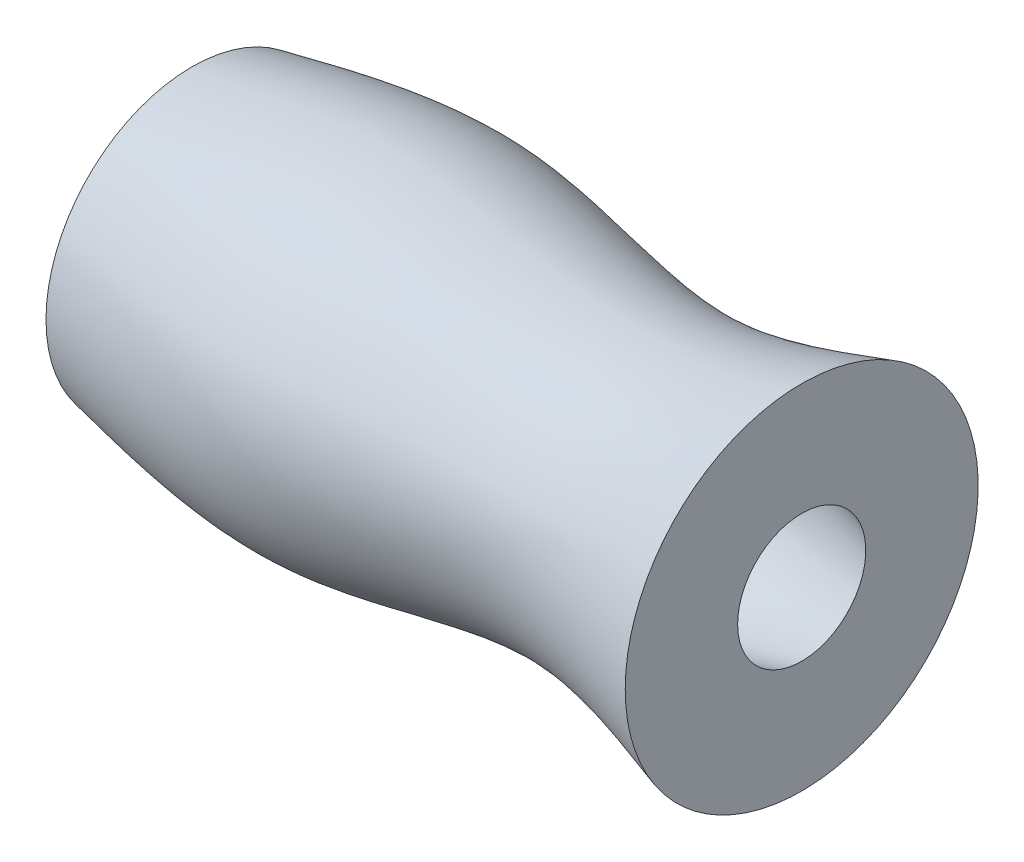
ISO-10303-21;
HEADER;
FILE_DESCRIPTION(('STEP AP214'),'2;1');
FILE_NAME('part.step','',(''),(''),'','','');
FILE_SCHEMA(('AUTOMOTIVE_DESIGN { 1 0 10303 214 1 1 1 1 }'));
ENDSEC;
DATA;
#1=APPLICATION_CONTEXT('core data for automotive mechanical design processes');
#2=APPLICATION_PROTOCOL_DEFINITION('international standard','automotive_design',2000,#1);
#3=PRODUCT_CONTEXT('',#1,'mechanical');
#4=PRODUCT('Part','Part','',(#3));
#5=PRODUCT_RELATED_PRODUCT_CATEGORY('part','',(#4));
#6=PRODUCT_DEFINITION_FORMATION('','',#4);
#7=PRODUCT_DEFINITION_CONTEXT('part definition',#1,'design');
#8=PRODUCT_DEFINITION('design','',#6,#7);
#9=PRODUCT_DEFINITION_SHAPE('','',#8);
#10=(LENGTH_UNIT() NAMED_UNIT(*) SI_UNIT(.MILLI.,.METRE.));
#11=(NAMED_UNIT(*) PLANE_ANGLE_UNIT() SI_UNIT($,.RADIAN.));
#12=(NAMED_UNIT(*) SI_UNIT($,.STERADIAN.) SOLID_ANGLE_UNIT());
#13=UNCERTAINTY_MEASURE_WITH_UNIT(LENGTH_MEASURE(1.E-05),#10,'distance_accuracy_value','');
#14=(GEOMETRIC_REPRESENTATION_CONTEXT(3) GLOBAL_UNCERTAINTY_ASSIGNED_CONTEXT((#13)) GLOBAL_UNIT_ASSIGNED_CONTEXT((#10,
#11,#12)) REPRESENTATION_CONTEXT('',''));
#15=CARTESIAN_POINT('',(0.,0.,0.));
#16=DIRECTION('',(0.,0.,1.));
#17=DIRECTION('',(1.,0.,0.));
#18=AXIS2_PLACEMENT_3D('',#15,#16,#17);
#19=CARTESIAN_POINT('',(109.052357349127,31.5622688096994,0.));
#20=DIRECTION('',(-1.,0.,0.));
#21=DIRECTION('',(0.,0.,1.));
#22=AXIS2_PLACEMENT_3D('',#19,#20,#21);
#23=PLANE('',#22);
#24=CARTESIAN_POINT('',(109.052357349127,0.,0.));
#25=DIRECTION('',(-1.,0.,0.));
#26=DIRECTION('',(0.,0.,1.));
#27=AXIS2_PLACEMENT_3D('',#24,#25,#26);
#28=CIRCLE('',#27,31.5622688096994);
#29=CARTESIAN_POINT('',(109.052357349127,0.,31.5622688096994));
#30=VERTEX_POINT('',#29);
#31=EDGE_CURVE('E10',#30,#30,#28,.T.);
#32=ORIENTED_EDGE('',*,*,#31,.F.);
#33=EDGE_LOOP('',(#32));
#34=FACE_BOUND('',#33,.T.);
#35=CARTESIAN_POINT('',(109.052357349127,0.,0.));
#36=DIRECTION('',(-1.,0.,0.));
#37=DIRECTION('',(0.,0.,1.));
#38=AXIS2_PLACEMENT_3D('',#35,#36,#37);
#39=CIRCLE('',#38,11.459572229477);
#40=CARTESIAN_POINT('',(109.052357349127,0.,11.459572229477));
#41=VERTEX_POINT('',#40);
#42=EDGE_CURVE('E41',#41,#41,#39,.T.);
#43=ORIENTED_EDGE('',*,*,#42,.T.);
#44=EDGE_LOOP('',(#43));
#45=FACE_BOUND('',#44,.T.);
#46=ADVANCED_FACE('F31',(#34,#45),#23,.F.);
#47=CARTESIAN_POINT('',(0.,26.109650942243,0.));
#48=DIRECTION('',(1.,0.,0.));
#49=DIRECTION('',(0.,0.,-1.));
#50=AXIS2_PLACEMENT_3D('',#47,#48,#49);
#51=PLANE('',#50);
#52=CARTESIAN_POINT('',(0.,0.,0.));
#53=DIRECTION('',(-1.,0.,0.));
#54=DIRECTION('',(0.,0.,1.));
#55=AXIS2_PLACEMENT_3D('',#52,#53,#54);
#56=CIRCLE('',#55,26.109650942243);
#57=CARTESIAN_POINT('',(0.,0.,26.109650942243));
#58=VERTEX_POINT('',#57);
#59=EDGE_CURVE('E37',#58,#58,#56,.T.);
#60=ORIENTED_EDGE('',*,*,#59,.T.);
#61=EDGE_LOOP('',(#60));
#62=FACE_BOUND('',#61,.T.);
#63=CARTESIAN_POINT('',(0.,0.,0.));
#64=DIRECTION('',(-1.,0.,0.));
#65=DIRECTION('',(0.,0.,1.));
#66=AXIS2_PLACEMENT_3D('',#63,#64,#65);
#67=CIRCLE('',#66,19.317564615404);
#68=CARTESIAN_POINT('',(0.,0.,19.317564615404));
#69=VERTEX_POINT('',#68);
#70=EDGE_CURVE('E45',#69,#69,#67,.T.);
#71=ORIENTED_EDGE('',*,*,#70,.F.);
#72=EDGE_LOOP('',(#71));
#73=FACE_BOUND('',#72,.T.);
#74=ADVANCED_FACE('F59',(#62,#73),#51,.F.);
#75=CARTESIAN_POINT('',(109.052357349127,31.5622688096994,0.));
#76=CARTESIAN_POINT('',(99.2281155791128,28.4520045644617,0.));
#77=CARTESIAN_POINT('',(75.9491963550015,21.0821136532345,0.));
#78=CARTESIAN_POINT('',(39.2953948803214,34.1859527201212,0.));
#79=CARTESIAN_POINT('',(12.7857413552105,28.7374780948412,0.));
#80=CARTESIAN_POINT('',(0.,26.109650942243,0.));
#81=B_SPLINE_CURVE_WITH_KNOTS('',3,(#75,#76,#77,#78,#79,#80),.UNSPECIFIED.,.F.,.F.,(4,1,1,4),
(0.,0.274314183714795,0.649998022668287,1.),.UNSPECIFIED.);
#82=CARTESIAN_POINT('',(0.,0.,0.));
#83=DIRECTION('',(-1.,0.,0.));
#84=AXIS1_PLACEMENT('',#82,#83);
#85=SURFACE_OF_REVOLUTION('',#81,#84);
#86=ORIENTED_EDGE('',*,*,#59,.F.);
#87=EDGE_LOOP('',(#86));
#88=FACE_BOUND('',#87,.T.);
#89=ORIENTED_EDGE('',*,*,#31,.T.);
#90=EDGE_LOOP('',(#89));
#91=FACE_BOUND('',#90,.T.);
#92=ADVANCED_FACE('F55',(#88,#91),#85,.T.);
#93=CARTESIAN_POINT('',(109.052357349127,11.459572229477,0.));
#94=CARTESIAN_POINT('',(100.926492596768,13.6159233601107,0.));
#95=CARTESIAN_POINT('',(83.3188969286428,18.2884302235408,0.));
#96=CARTESIAN_POINT('',(56.9360791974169,6.97266803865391,0.));
#97=CARTESIAN_POINT('',(35.3592846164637,23.5973349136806,0.));
#98=CARTESIAN_POINT('',(16.0546793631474,16.2318874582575,0.));
#99=CARTESIAN_POINT('',(4.93256098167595,18.3695362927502,0.));
#100=CARTESIAN_POINT('',(0.,19.317564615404,0.));
#101=B_SPLINE_CURVE_WITH_KNOTS('',3,(#93,#94,#95,#96,#97,#98,#99,#100),.UNSPECIFIED.,.F.,.F.,(4,
1,1,1,1,4),(0.,0.223626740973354,0.48456740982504,0.696844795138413,0.865553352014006,1.),.UNSPECIFIED.);
#102=CARTESIAN_POINT('',(0.,0.,0.));
#103=DIRECTION('',(-1.,0.,0.));
#104=AXIS1_PLACEMENT('',#102,#103);
#105=SURFACE_OF_REVOLUTION('',#101,#104);
#106=ORIENTED_EDGE('',*,*,#70,.T.);
#107=EDGE_LOOP('',(#106));
#108=FACE_BOUND('',#107,.T.);
#109=ORIENTED_EDGE('',*,*,#42,.F.);
#110=EDGE_LOOP('',(#109));
#111=FACE_BOUND('',#110,.T.);
#112=ADVANCED_FACE('F58',(#108,#111),#105,.F.);
#113=CLOSED_SHELL('',(#46,#74,#92,#112));
#114=MANIFOLD_SOLID_BREP('B2',#113);
#115=ADVANCED_BREP_SHAPE_REPRESENTATION('',(#18,#114),#14);
#116=SHAPE_DEFINITION_REPRESENTATION(#9,#115);
ENDSEC;
END-ISO-10303-21;
